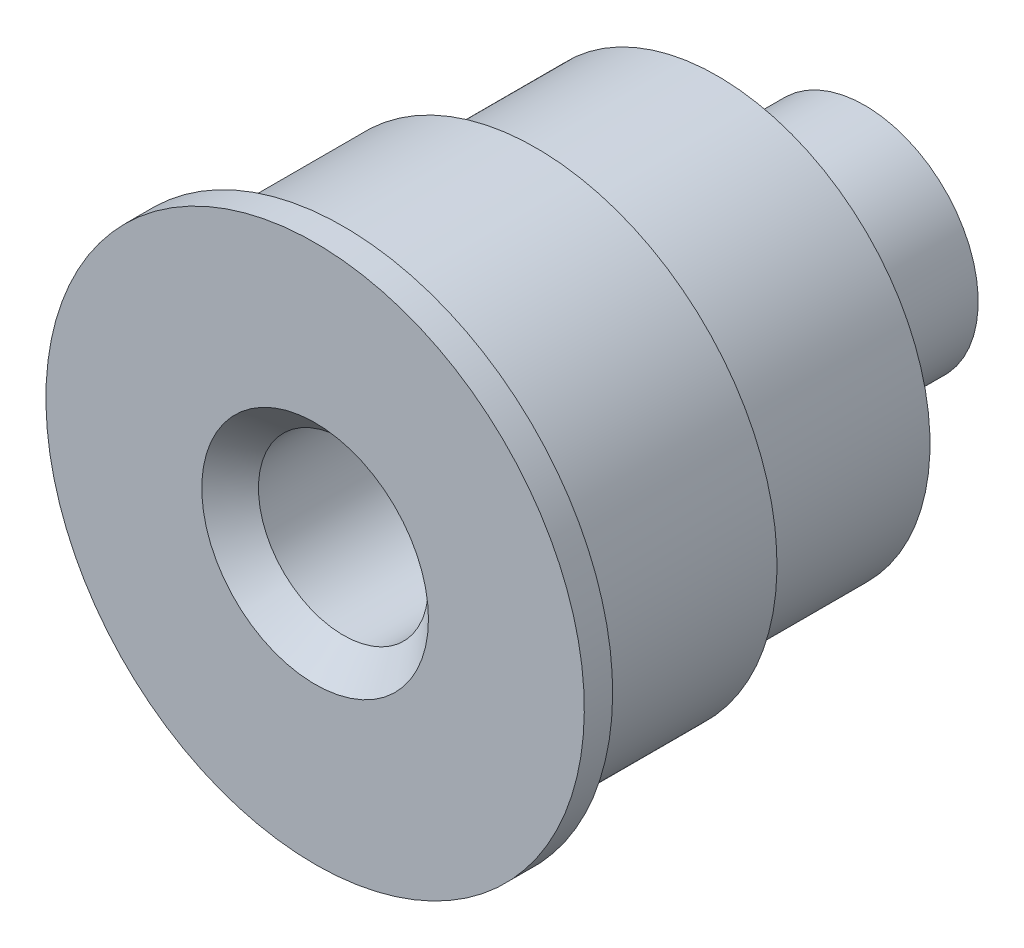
ISO-10303-21;
HEADER;
FILE_DESCRIPTION(('STEP AP214'),'2;1');
FILE_NAME('part.step','',(''),(''),'','','');
FILE_SCHEMA(('AUTOMOTIVE_DESIGN { 1 0 10303 214 1 1 1 1 }'));
ENDSEC;
DATA;
#1=APPLICATION_CONTEXT('core data for automotive mechanical design processes');
#2=APPLICATION_PROTOCOL_DEFINITION('international standard','automotive_design',2000,#1);
#3=PRODUCT_CONTEXT('',#1,'mechanical');
#4=PRODUCT('Part','Part','',(#3));
#5=PRODUCT_RELATED_PRODUCT_CATEGORY('part','',(#4));
#6=PRODUCT_DEFINITION_FORMATION('','',#4);
#7=PRODUCT_DEFINITION_CONTEXT('part definition',#1,'design');
#8=PRODUCT_DEFINITION('design','',#6,#7);
#9=PRODUCT_DEFINITION_SHAPE('','',#8);
#10=(LENGTH_UNIT() NAMED_UNIT(*) SI_UNIT(.MILLI.,.METRE.));
#11=(NAMED_UNIT(*) PLANE_ANGLE_UNIT() SI_UNIT($,.RADIAN.));
#12=(NAMED_UNIT(*) SI_UNIT($,.STERADIAN.) SOLID_ANGLE_UNIT());
#13=UNCERTAINTY_MEASURE_WITH_UNIT(LENGTH_MEASURE(1.E-05),#10,'distance_accuracy_value','');
#14=(GEOMETRIC_REPRESENTATION_CONTEXT(3) GLOBAL_UNCERTAINTY_ASSIGNED_CONTEXT((#13)) GLOBAL_UNIT_ASSIGNED_CONTEXT((#10,
#11,#12)) REPRESENTATION_CONTEXT('',''));
#15=CARTESIAN_POINT('',(0.,0.,0.));
#16=DIRECTION('',(0.,0.,1.));
#17=DIRECTION('',(1.,0.,0.));
#18=AXIS2_PLACEMENT_3D('',#15,#16,#17);
#19=CARTESIAN_POINT('',(15.4712812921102,1.6,-9.6));
#20=DIRECTION('',(0.,0.,-1.));
#21=DIRECTION('',(-0.5,0.866025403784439,0.));
#22=AXIS2_PLACEMENT_3D('',#19,#20,#21);
#23=PLANE('',#22);
#24=CARTESIAN_POINT('',(12.7,0.,-9.6));
#25=DIRECTION('',(0.,0.,-1.));
#26=DIRECTION('',(-1.,0.,0.));
#27=AXIS2_PLACEMENT_3D('',#24,#25,#26);
#28=CIRCLE('',#27,1.5);
#29=CARTESIAN_POINT('',(11.2,0.,-9.6));
#30=VERTEX_POINT('',#29);
#31=EDGE_CURVE('E30',#30,#30,#28,.F.);
#32=ORIENTED_EDGE('',*,*,#31,.T.);
#33=EDGE_LOOP('',(#32));
#34=FACE_BOUND('',#33,.T.);
#35=CARTESIAN_POINT('',(12.7,0.,-9.6));
#36=DIRECTION('',(0.,0.,-1.));
#37=DIRECTION('',(-1.,0.,0.));
#38=AXIS2_PLACEMENT_3D('',#35,#36,#37);
#39=CIRCLE('',#38,2.);
#40=CARTESIAN_POINT('',(10.7,0.,-9.6));
#41=VERTEX_POINT('',#40);
#42=EDGE_CURVE('E45',#41,#41,#39,.F.);
#43=ORIENTED_EDGE('',*,*,#42,.F.);
#44=EDGE_LOOP('',(#43));
#45=FACE_BOUND('',#44,.T.);
#46=ADVANCED_FACE('F14',(#34,#45),#23,.T.);
#47=CARTESIAN_POINT('',(12.7,0.,0.1));
#48=DIRECTION('',(0.,0.,1.));
#49=DIRECTION('',(0.5,-0.866025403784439,0.));
#50=AXIS2_PLACEMENT_3D('',#47,#48,#49);
#51=CYLINDRICAL_SURFACE('',#50,1.5);
#52=CARTESIAN_POINT('',(12.7,0.,-0.4));
#53=DIRECTION('',(0.,0.,1.));
#54=DIRECTION('',(1.,0.,0.));
#55=AXIS2_PLACEMENT_3D('',#52,#53,#54);
#56=CIRCLE('',#55,1.5);
#57=CARTESIAN_POINT('',(14.2,0.,-0.4));
#58=VERTEX_POINT('',#57);
#59=EDGE_CURVE('E22',#58,#58,#56,.T.);
#60=ORIENTED_EDGE('',*,*,#59,.T.);
#61=EDGE_LOOP('',(#60));
#62=FACE_BOUND('',#61,.T.);
#63=ORIENTED_EDGE('',*,*,#31,.F.);
#64=EDGE_LOOP('',(#63));
#65=FACE_BOUND('',#64,.T.);
#66=ADVANCED_FACE('F91',(#62,#65),#51,.F.);
#67=CARTESIAN_POINT('',(14.8650635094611,1.25,0.1));
#68=DIRECTION('',(0.,0.,1.));
#69=DIRECTION('',(0.5,-0.866025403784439,0.));
#70=AXIS2_PLACEMENT_3D('',#67,#68,#69);
#71=PLANE('',#70);
#72=CARTESIAN_POINT('',(12.7,0.,0.1));
#73=DIRECTION('',(0.,0.,1.));
#74=DIRECTION('',(1.,0.,0.));
#75=AXIS2_PLACEMENT_3D('',#72,#73,#74);
#76=CIRCLE('',#75,2.);
#77=CARTESIAN_POINT('',(14.7,0.,0.1));
#78=VERTEX_POINT('',#77);
#79=EDGE_CURVE('E10',#78,#78,#76,.F.);
#80=ORIENTED_EDGE('',*,*,#79,.T.);
#81=EDGE_LOOP('',(#80));
#82=FACE_BOUND('',#81,.T.);
#83=CARTESIAN_POINT('',(12.7,0.,0.1));
#84=DIRECTION('',(0.,0.,1.));
#85=DIRECTION('',(0.5,-0.866025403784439,0.));
#86=AXIS2_PLACEMENT_3D('',#83,#84,#85);
#87=CIRCLE('',#86,4.75);
#88=CARTESIAN_POINT('',(15.075,-4.11362066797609,0.1));
#89=VERTEX_POINT('',#88);
#90=EDGE_CURVE('E37',#89,#89,#87,.T.);
#91=ORIENTED_EDGE('',*,*,#90,.T.);
#92=EDGE_LOOP('',(#91));
#93=FACE_BOUND('',#92,.T.);
#94=ADVANCED_FACE('F98',(#82,#93),#71,.T.);
#95=CARTESIAN_POINT('',(12.7,0.,0.1));
#96=DIRECTION('',(0.,0.,1.));
#97=DIRECTION('',(0.5,-0.866025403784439,0.));
#98=AXIS2_PLACEMENT_3D('',#95,#96,#97);
#99=CYLINDRICAL_SURFACE('',#98,4.75);
#100=CARTESIAN_POINT('',(12.7,0.,-0.4));
#101=DIRECTION('',(0.,0.,1.));
#102=DIRECTION('',(0.5,-0.866025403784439,0.));
#103=AXIS2_PLACEMENT_3D('',#100,#101,#102);
#104=CIRCLE('',#103,4.75);
#105=CARTESIAN_POINT('',(15.075,-4.11362066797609,-0.4));
#106=VERTEX_POINT('',#105);
#107=EDGE_CURVE('E52',#106,#106,#104,.T.);
#108=ORIENTED_EDGE('',*,*,#107,.T.);
#109=EDGE_LOOP('',(#108));
#110=FACE_BOUND('',#109,.T.);
#111=ORIENTED_EDGE('',*,*,#90,.F.);
#112=EDGE_LOOP('',(#111));
#113=FACE_BOUND('',#112,.T.);
#114=ADVANCED_FACE('F103',(#110,#113),#99,.T.);
#115=CARTESIAN_POINT('',(16.8136206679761,2.375,-0.4));
#116=DIRECTION('',(0.,0.,-1.));
#117=DIRECTION('',(-0.5,0.866025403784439,0.));
#118=AXIS2_PLACEMENT_3D('',#115,#116,#117);
#119=PLANE('',#118);
#120=CARTESIAN_POINT('',(12.7,0.,-0.4));
#121=DIRECTION('',(0.,0.,1.));
#122=DIRECTION('',(0.5,-0.866025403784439,0.));
#123=AXIS2_PLACEMENT_3D('',#120,#121,#122);
#124=CIRCLE('',#123,4.25);
#125=CARTESIAN_POINT('',(14.825,-3.68060796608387,-0.4));
#126=VERTEX_POINT('',#125);
#127=EDGE_CURVE('E56',#126,#126,#124,.T.);
#128=ORIENTED_EDGE('',*,*,#127,.T.);
#129=EDGE_LOOP('',(#128));
#130=FACE_BOUND('',#129,.T.);
#131=ORIENTED_EDGE('',*,*,#107,.F.);
#132=EDGE_LOOP('',(#131));
#133=FACE_BOUND('',#132,.T.);
#134=ADVANCED_FACE('F106',(#130,#133),#119,.T.);
#135=CARTESIAN_POINT('',(12.7,0.,0.1));
#136=DIRECTION('',(0.,0.,1.));
#137=DIRECTION('',(0.5,-0.866025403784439,0.));
#138=AXIS2_PLACEMENT_3D('',#135,#136,#137);
#139=CYLINDRICAL_SURFACE('',#138,4.25);
#140=CARTESIAN_POINT('',(12.7,0.,-3.8));
#141=DIRECTION('',(0.,0.,1.));
#142=DIRECTION('',(0.5,-0.866025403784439,0.));
#143=AXIS2_PLACEMENT_3D('',#140,#141,#142);
#144=CIRCLE('',#143,4.25);
#145=CARTESIAN_POINT('',(14.825,-3.68060796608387,-3.8));
#146=VERTEX_POINT('',#145);
#147=EDGE_CURVE('E60',#146,#146,#144,.T.);
#148=ORIENTED_EDGE('',*,*,#147,.T.);
#149=EDGE_LOOP('',(#148));
#150=FACE_BOUND('',#149,.T.);
#151=ORIENTED_EDGE('',*,*,#127,.F.);
#152=EDGE_LOOP('',(#151));
#153=FACE_BOUND('',#152,.T.);
#154=ADVANCED_FACE('F110',(#150,#153),#139,.T.);
#155=CARTESIAN_POINT('',(16.3806079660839,2.125,-3.8));
#156=DIRECTION('',(0.,0.,-1.));
#157=DIRECTION('',(-0.5,0.866025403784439,0.));
#158=AXIS2_PLACEMENT_3D('',#155,#156,#157);
#159=PLANE('',#158);
#160=CARTESIAN_POINT('',(12.7,0.,-3.8));
#161=DIRECTION('',(0.,0.,1.));
#162=DIRECTION('',(0.5,-0.866025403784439,0.));
#163=AXIS2_PLACEMENT_3D('',#160,#161,#162);
#164=CIRCLE('',#163,3.75);
#165=CARTESIAN_POINT('',(14.575,-3.24759526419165,-3.8));
#166=VERTEX_POINT('',#165);
#167=EDGE_CURVE('E64',#166,#166,#164,.T.);
#168=ORIENTED_EDGE('',*,*,#167,.T.);
#169=EDGE_LOOP('',(#168));
#170=FACE_BOUND('',#169,.T.);
#171=ORIENTED_EDGE('',*,*,#147,.F.);
#172=EDGE_LOOP('',(#171));
#173=FACE_BOUND('',#172,.T.);
#174=ADVANCED_FACE('F88',(#170,#173),#159,.T.);
#175=CARTESIAN_POINT('',(12.7,0.,0.1));
#176=DIRECTION('',(0.,0.,1.));
#177=DIRECTION('',(0.5,-0.866025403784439,0.));
#178=AXIS2_PLACEMENT_3D('',#175,#176,#177);
#179=CYLINDRICAL_SURFACE('',#178,3.75);
#180=CARTESIAN_POINT('',(12.7,0.,-7.));
#181=DIRECTION('',(0.,0.,1.));
#182=DIRECTION('',(0.5,-0.866025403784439,0.));
#183=AXIS2_PLACEMENT_3D('',#180,#181,#182);
#184=CIRCLE('',#183,3.75);
#185=CARTESIAN_POINT('',(14.575,-3.24759526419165,-7.));
#186=VERTEX_POINT('',#185);
#187=EDGE_CURVE('E44',#186,#186,#184,.T.);
#188=ORIENTED_EDGE('',*,*,#187,.T.);
#189=EDGE_LOOP('',(#188));
#190=FACE_BOUND('',#189,.T.);
#191=ORIENTED_EDGE('',*,*,#167,.F.);
#192=EDGE_LOOP('',(#191));
#193=FACE_BOUND('',#192,.T.);
#194=ADVANCED_FACE('F73',(#190,#193),#179,.T.);
#195=CARTESIAN_POINT('',(15.9475952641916,1.875,-7.));
#196=DIRECTION('',(0.,0.,-1.));
#197=DIRECTION('',(-0.5,0.866025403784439,0.));
#198=AXIS2_PLACEMENT_3D('',#195,#196,#197);
#199=PLANE('',#198);
#200=CARTESIAN_POINT('',(12.7,0.,-7.));
#201=DIRECTION('',(0.,0.,-1.));
#202=DIRECTION('',(-1.,0.,0.));
#203=AXIS2_PLACEMENT_3D('',#200,#201,#202);
#204=CIRCLE('',#203,2.);
#205=CARTESIAN_POINT('',(10.7,0.,-7.));
#206=VERTEX_POINT('',#205);
#207=EDGE_CURVE('E40',#206,#206,#204,.F.);
#208=ORIENTED_EDGE('',*,*,#207,.T.);
#209=EDGE_LOOP('',(#208));
#210=FACE_BOUND('',#209,.T.);
#211=ORIENTED_EDGE('',*,*,#187,.F.);
#212=EDGE_LOOP('',(#211));
#213=FACE_BOUND('',#212,.T.);
#214=ADVANCED_FACE('F76',(#210,#213),#199,.T.);
#215=CARTESIAN_POINT('',(12.7,0.,0.1));
#216=DIRECTION('',(0.,0.,1.));
#217=DIRECTION('',(0.5,-0.866025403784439,0.));
#218=AXIS2_PLACEMENT_3D('',#215,#216,#217);
#219=CYLINDRICAL_SURFACE('',#218,2.);
#220=ORIENTED_EDGE('',*,*,#42,.T.);
#221=EDGE_LOOP('',(#220));
#222=FACE_BOUND('',#221,.T.);
#223=ORIENTED_EDGE('',*,*,#207,.F.);
#224=EDGE_LOOP('',(#223));
#225=FACE_BOUND('',#224,.T.);
#226=ADVANCED_FACE('F78',(#222,#225),#219,.T.);
#227=CARTESIAN_POINT('',(12.7,0.,-0.4));
#228=DIRECTION('',(0.,0.,1.));
#229=DIRECTION('',(1.,0.,0.));
#230=AXIS2_PLACEMENT_3D('',#227,#228,#229);
#231=CONICAL_SURFACE('',#230,1.5,0.785398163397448);
#232=ORIENTED_EDGE('',*,*,#79,.F.);
#233=EDGE_LOOP('',(#232));
#234=FACE_BOUND('',#233,.T.);
#235=ORIENTED_EDGE('',*,*,#59,.F.);
#236=EDGE_LOOP('',(#235));
#237=FACE_BOUND('',#236,.T.);
#238=ADVANCED_FACE('F16',(#234,#237),#231,.F.);
#239=CLOSED_SHELL('',(#46,#66,#94,#114,#134,#154,#174,#194,#214,#226,#238));
#240=MANIFOLD_SOLID_BREP('B1',#239);
#241=ADVANCED_BREP_SHAPE_REPRESENTATION('',(#18,#240),#14);
#242=SHAPE_DEFINITION_REPRESENTATION(#9,#241);
ENDSEC;
END-ISO-10303-21;
